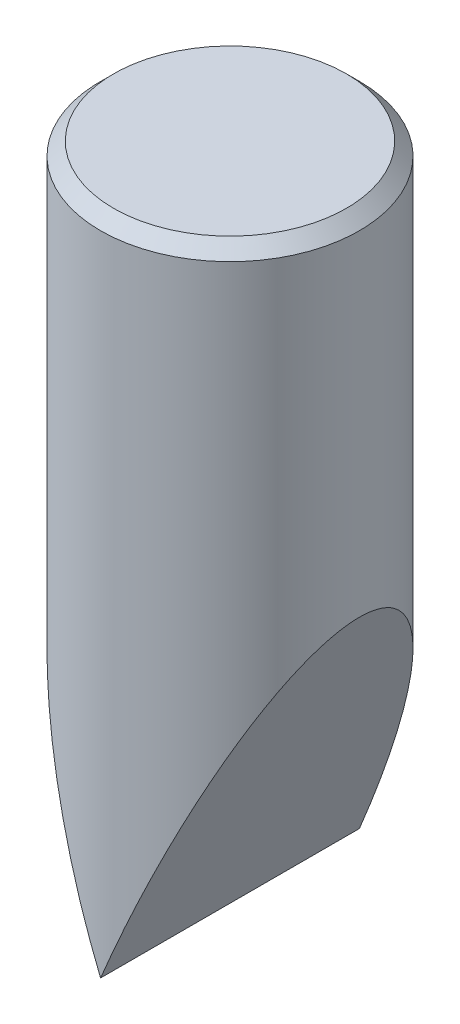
ISO-10303-21;
HEADER;
FILE_DESCRIPTION(('STEP AP214'),'2;1');
FILE_NAME('part.step','',(''),(''),'','','');
FILE_SCHEMA(('AUTOMOTIVE_DESIGN { 1 0 10303 214 1 1 1 1 }'));
ENDSEC;
DATA;
#1=APPLICATION_CONTEXT('core data for automotive mechanical design processes');
#2=APPLICATION_PROTOCOL_DEFINITION('international standard','automotive_design',2000,#1);
#3=PRODUCT_CONTEXT('',#1,'mechanical');
#4=PRODUCT('Part','Part','',(#3));
#5=PRODUCT_RELATED_PRODUCT_CATEGORY('part','',(#4));
#6=PRODUCT_DEFINITION_FORMATION('','',#4);
#7=PRODUCT_DEFINITION_CONTEXT('part definition',#1,'design');
#8=PRODUCT_DEFINITION('design','',#6,#7);
#9=PRODUCT_DEFINITION_SHAPE('','',#8);
#10=(LENGTH_UNIT() NAMED_UNIT(*) SI_UNIT(.MILLI.,.METRE.));
#11=(NAMED_UNIT(*) PLANE_ANGLE_UNIT() SI_UNIT($,.RADIAN.));
#12=(NAMED_UNIT(*) SI_UNIT($,.STERADIAN.) SOLID_ANGLE_UNIT());
#13=UNCERTAINTY_MEASURE_WITH_UNIT(LENGTH_MEASURE(1.E-05),#10,'distance_accuracy_value','');
#14=(GEOMETRIC_REPRESENTATION_CONTEXT(3) GLOBAL_UNCERTAINTY_ASSIGNED_CONTEXT((#13)) GLOBAL_UNIT_ASSIGNED_CONTEXT((#10,
#11,#12)) REPRESENTATION_CONTEXT('',''));
#15=CARTESIAN_POINT('',(0.,0.,0.));
#16=DIRECTION('',(0.,0.,1.));
#17=DIRECTION('',(1.,0.,0.));
#18=AXIS2_PLACEMENT_3D('',#15,#16,#17);
#19=CARTESIAN_POINT('',(0.,25.5,0.));
#20=DIRECTION('',(0.,-1.,0.));
#21=DIRECTION('',(0.,0.,-1.));
#22=AXIS2_PLACEMENT_3D('',#19,#20,#21);
#23=CYLINDRICAL_SURFACE('',#22,5.);
#24=CARTESIAN_POINT('',(0.,25.,0.));
#25=DIRECTION('',(0.,1.,0.));
#26=DIRECTION('',(0.,0.,1.));
#27=AXIS2_PLACEMENT_3D('',#24,#25,#26);
#28=CIRCLE('',#27,5.);
#29=CARTESIAN_POINT('',(0.,25.,5.));
#30=VERTEX_POINT('',#29);
#31=EDGE_CURVE('E11',#30,#30,#28,.F.);
#32=ORIENTED_EDGE('',*,*,#31,.T.);
#33=EDGE_LOOP('',(#32));
#34=FACE_BOUND('',#33,.T.);
#35=CARTESIAN_POINT('',(0.,0.,0.));
#36=DIRECTION('',(-0.923879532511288,0.382683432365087,0.));
#37=DIRECTION('',(-0.382683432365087,-0.923879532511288,0.));
#38=AXIS2_PLACEMENT_3D('',#35,#36,#37);
#39=ELLIPSE('',#38,13.0656296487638,5.);
#40=CARTESIAN_POINT('',(0.,0.,5.));
#41=VERTEX_POINT('',#40);
#42=CARTESIAN_POINT('',(0.,0.,-5.));
#43=VERTEX_POINT('',#42);
#44=EDGE_CURVE('E45',#41,#43,#39,.T.);
#45=ORIENTED_EDGE('',*,*,#44,.T.);
#46=CARTESIAN_POINT('',(0.,0.,0.));
#47=DIRECTION('',(0.923879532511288,0.382683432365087,0.));
#48=DIRECTION('',(0.382683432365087,-0.923879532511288,0.));
#49=AXIS2_PLACEMENT_3D('',#46,#47,#48);
#50=ELLIPSE('',#49,13.0656296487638,5.);
#51=EDGE_CURVE('E48',#43,#41,#50,.T.);
#52=ORIENTED_EDGE('',*,*,#51,.T.);
#53=EDGE_LOOP('',(#45,#52));
#54=FACE_BOUND('',#53,.T.);
#55=ADVANCED_FACE('F31',(#34,#54),#23,.T.);
#56=CARTESIAN_POINT('',(0.,25.5,0.));
#57=DIRECTION('',(0.,1.,0.));
#58=DIRECTION('',(0.,0.,1.));
#59=AXIS2_PLACEMENT_3D('',#56,#57,#58);
#60=PLANE('',#59);
#61=CARTESIAN_POINT('',(0.,25.5,0.));
#62=DIRECTION('',(0.,1.,0.));
#63=DIRECTION('',(0.,0.,1.));
#64=AXIS2_PLACEMENT_3D('',#61,#62,#63);
#65=CIRCLE('',#64,4.49999999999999);
#66=CARTESIAN_POINT('',(0.,25.5,4.49999999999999));
#67=VERTEX_POINT('',#66);
#68=EDGE_CURVE('E39',#67,#67,#65,.T.);
#69=ORIENTED_EDGE('',*,*,#68,.T.);
#70=EDGE_LOOP('',(#69));
#71=FACE_BOUND('',#70,.T.);
#72=ADVANCED_FACE('F61',(#71),#60,.T.);
#73=CARTESIAN_POINT('',(-5.,12.0710678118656,-12.75));
#74=DIRECTION('',(0.923879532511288,0.382683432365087,0.));
#75=DIRECTION('',(-0.382683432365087,0.923879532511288,0.));
#76=AXIS2_PLACEMENT_3D('',#73,#74,#75);
#77=PLANE('',#76);
#78=DIRECTION('',(0.,0.,1.));
#79=VECTOR('',#78,1.);
#80=CARTESIAN_POINT('',(0.,0.,-12.75));
#81=LINE('',#80,#79);
#82=EDGE_CURVE('E54',#43,#41,#81,.T.);
#83=ORIENTED_EDGE('',*,*,#82,.T.);
#84=ORIENTED_EDGE('',*,*,#51,.F.);
#85=EDGE_LOOP('',(#83,#84));
#86=FACE_BOUND('',#85,.T.);
#87=ADVANCED_FACE('F56',(#86),#77,.F.);
#88=CARTESIAN_POINT('',(0.,0.,-12.75));
#89=DIRECTION('',(-0.923879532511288,0.382683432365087,0.));
#90=DIRECTION('',(-0.382683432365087,-0.923879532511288,0.));
#91=AXIS2_PLACEMENT_3D('',#88,#89,#90);
#92=PLANE('',#91);
#93=ORIENTED_EDGE('',*,*,#82,.F.);
#94=ORIENTED_EDGE('',*,*,#44,.F.);
#95=EDGE_LOOP('',(#93,#94));
#96=FACE_BOUND('',#95,.T.);
#97=ADVANCED_FACE('F53',(#96),#92,.F.);
#98=CARTESIAN_POINT('',(0.,25.5,0.));
#99=DIRECTION('',(0.,-1.,0.));
#100=DIRECTION('',(0.,0.,-1.));
#101=AXIS2_PLACEMENT_3D('',#98,#99,#100);
#102=CONICAL_SURFACE('',#101,4.49999999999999,0.785398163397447);
#103=ORIENTED_EDGE('',*,*,#31,.F.);
#104=EDGE_LOOP('',(#103));
#105=FACE_BOUND('',#104,.T.);
#106=ORIENTED_EDGE('',*,*,#68,.F.);
#107=EDGE_LOOP('',(#106));
#108=FACE_BOUND('',#107,.T.);
#109=ADVANCED_FACE('F33',(#105,#108),#102,.T.);
#110=CLOSED_SHELL('',(#55,#72,#87,#97,#109));
#111=MANIFOLD_SOLID_BREP('B2',#110);
#112=ADVANCED_BREP_SHAPE_REPRESENTATION('',(#18,#111),#14);
#113=SHAPE_DEFINITION_REPRESENTATION(#9,#112);
ENDSEC;
END-ISO-10303-21;
